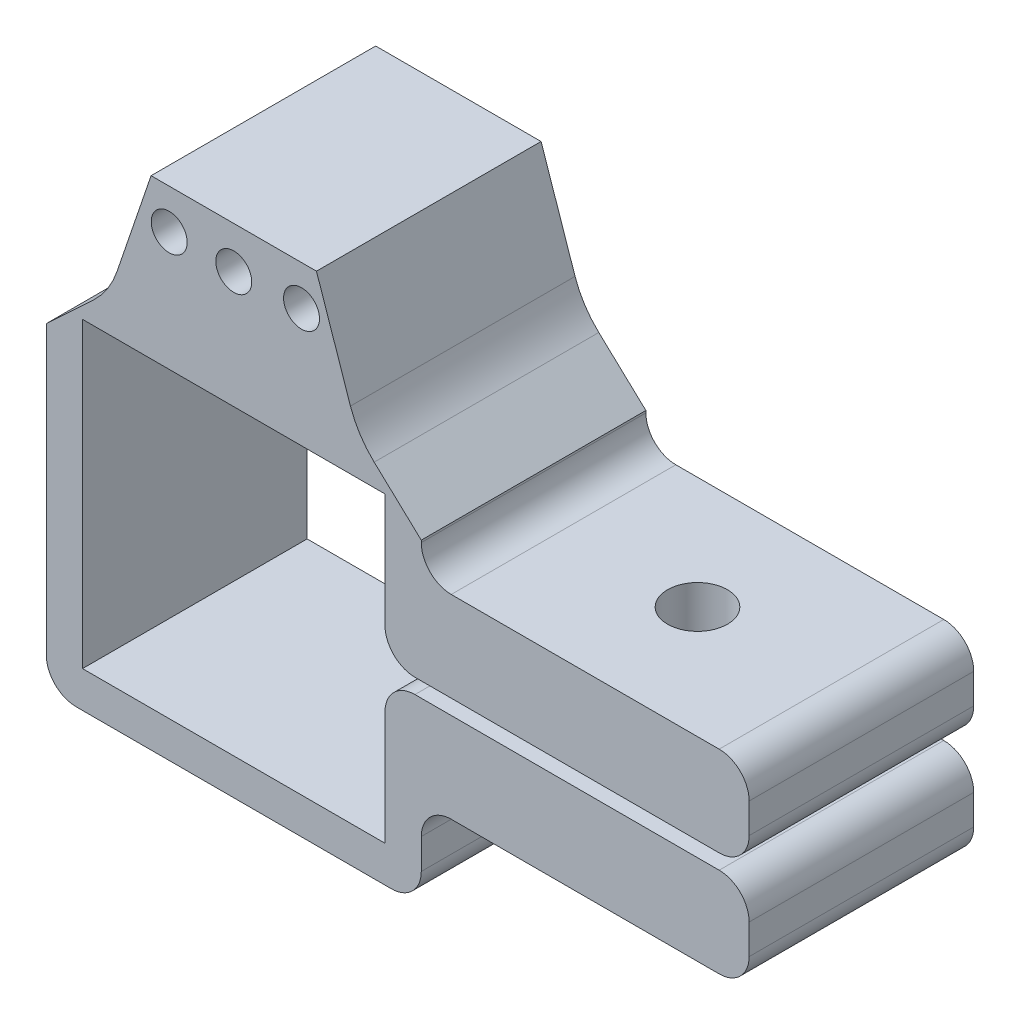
from build123d import *

# Parameters (mm, degrees)
SKETCH1_R           = 1.2
BOSS_EXTRUDE1_DEPTH = 15
SKETCH2_R           = 2
CUT_EXTRUDE1_DEPTH  = 15
CUT_EXTRUDE4_DEPTH  = 15


with BuildPart() as part:
    # Sketch1 → Boss-Extrude1 (new body)
    with BuildSketch(Plane.XY):
        with BuildLine():
            Line((-237.442156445, -7.401419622), (-217.242156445, -7.401419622))
            Line((-217.242156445, -7.401419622), (-217.242156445, 0.198580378))
            ThreePointArc((-217.242156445, 0.198580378), (-216.656370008, 1.61279394), (-215.242156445, 2.198580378))
            Line((-215.242156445, 2.198580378), (-194.925815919, 2.198580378))
            ThreePointArc((-194.925815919, 2.198580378), (-193.511602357, 1.61279394), (-192.925815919, 0.198580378))
            Line((-192.925815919, 0.198580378), (-192.925815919, -1.801419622))
            ThreePointArc((-192.925815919, -1.801419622), (-193.511602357, -3.215633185), (-194.925815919, -3.801419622))
            Line((-194.925815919, -3.801419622), (-212.820078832, -3.801419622))
            ThreePointArc((-212.820078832, -3.801419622), (-214.234292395, -4.38720606), (-214.820078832, -5.801419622))
            Line((-214.820078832, -5.801419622), (-214.820078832, -7.823495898))
            ThreePointArc((-214.820078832, -7.823495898), (-215.40586527, -9.23770946), (-216.820078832, -9.823495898))
            Line((-216.820078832, -9.823495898), (-237.86399037, -9.823495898))
            ThreePointArc((-237.86399037, -9.823495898), (-239.278203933, -9.23770946), (-239.86399037, -7.823495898))
            Line((-239.86399037, -7.823495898), (-239.86399037, 16.395861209))
            ThreePointArc((-239.86399037, 16.395861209), (-237.813737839, 21.345608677), (-232.86399037, 23.395861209))
            Line((-232.86399037, 23.395861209), (-221.820078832, 23.395861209))
            ThreePointArc((-221.820078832, 23.395861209), (-216.870331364, 21.345608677), (-214.820078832, 16.395861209))
            Line((-214.820078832, 16.395861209), (-214.820078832, 11.198580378))
            ThreePointArc((-214.820078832, 11.198580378), (-214.234292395, 9.784366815), (-212.820078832, 9.198580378))
            Line((-212.820078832, 9.198580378), (-194.925815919, 9.198580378))
            ThreePointArc((-194.925815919, 9.198580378), (-193.511602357, 8.61279394), (-192.925815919, 7.198580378))
            Line((-192.925815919, 7.198580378), (-192.925815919, 5.198580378))
            ThreePointArc((-192.925815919, 5.198580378), (-193.511602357, 3.784366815), (-194.925815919, 3.198580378))
            Line((-194.925815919, 3.198580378), (-215.242156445, 3.198580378))
            ThreePointArc((-215.242156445, 3.198580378), (-216.656370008, 3.784366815), (-217.242156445, 5.198580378))
            Line((-217.242156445, 5.198580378), (-217.242156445, 12.798580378))
            Line((-217.242156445, 12.798580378), (-237.442156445, 12.798580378))
            Line((-237.442156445, 12.798580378), (-237.442156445, -7.401419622))
        make_face()
        with Locations((-231.654521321, 20.742319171)):
            Circle(SKETCH1_R, mode=Mode.SUBTRACT)
        with Locations((-227.342156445, 20.607774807)):
            Circle(SKETCH1_R, mode=Mode.SUBTRACT)
        with Locations((-222.817251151, 20.742319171)):
            Circle(SKETCH1_R, mode=Mode.SUBTRACT)
    extrude(amount=BOSS_EXTRUDE1_DEPTH)

    # Sketch2 → Cut-Extrude1 (cut)
    with BuildSketch(Plane(origin=(0, 9.198580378, 0), x_dir=(-1, 0, 0), z_dir=(0, 1, 0))):
        with Locations((203.872947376, 7.5)):
            Circle(SKETCH2_R)
    extrude(amount=-CUT_EXTRUDE1_DEPTH, mode=Mode.SUBTRACT)

    # Sketch3 → Cut-Extrude4 (cut)
    with BuildSketch(Plane.XY.offset(15)):
        with BuildLine():
            Line((-232.86399037, 23.395861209), (-235.134788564, 16.727689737))
            ThreePointArc((-235.134788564, 16.727689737), (-235.775582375, 15.404652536), (-236.718856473, 14.277142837))
            Line((-236.718856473, 14.277142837), (-239.86399037, 11.339377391))
            Line((-239.86399037, 11.339377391), (-239.86399037, 12.445382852))
            Line((-239.86399037, 12.445382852), (-239.86399037, 23.395861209))
            Line((-239.86399037, 23.395861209), (-232.86399037, 23.395861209))
        make_face()
        with BuildLine():
            Line((-221.820078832, 23.395861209), (-219.549280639, 16.727689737))
            ThreePointArc((-219.549280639, 16.727689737), (-218.908486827, 15.404652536), (-217.965212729, 14.277142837))
            Line((-217.965212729, 14.277142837), (-214.820078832, 11.339377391))
            Line((-214.820078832, 11.339377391), (-214.820078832, 23.395861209))
            Line((-214.820078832, 23.395861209), (-221.820078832, 23.395861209))
        make_face()
    extrude(amount=-CUT_EXTRUDE4_DEPTH, mode=Mode.SUBTRACT)


solid = part.part
